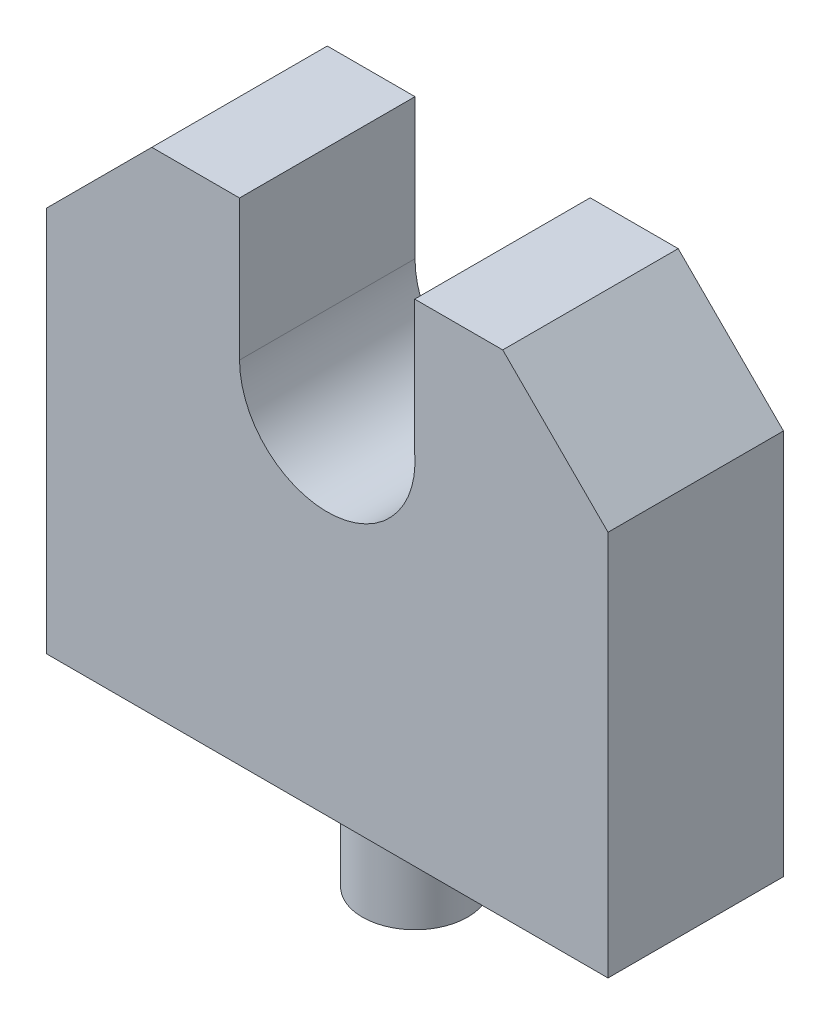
ISO-10303-21;
HEADER;
FILE_DESCRIPTION(('STEP AP214'),'2;1');
FILE_NAME('part.step','',(''),(''),'','','');
FILE_SCHEMA(('AUTOMOTIVE_DESIGN { 1 0 10303 214 1 1 1 1 }'));
ENDSEC;
DATA;
#1=APPLICATION_CONTEXT('core data for automotive mechanical design processes');
#2=APPLICATION_PROTOCOL_DEFINITION('international standard','automotive_design',2000,#1);
#3=PRODUCT_CONTEXT('',#1,'mechanical');
#4=PRODUCT('Part','Part','',(#3));
#5=PRODUCT_RELATED_PRODUCT_CATEGORY('part','',(#4));
#6=PRODUCT_DEFINITION_FORMATION('','',#4);
#7=PRODUCT_DEFINITION_CONTEXT('part definition',#1,'design');
#8=PRODUCT_DEFINITION('design','',#6,#7);
#9=PRODUCT_DEFINITION_SHAPE('','',#8);
#10=(LENGTH_UNIT() NAMED_UNIT(*) SI_UNIT(.MILLI.,.METRE.));
#11=(NAMED_UNIT(*) PLANE_ANGLE_UNIT() SI_UNIT($,.RADIAN.));
#12=(NAMED_UNIT(*) SI_UNIT($,.STERADIAN.) SOLID_ANGLE_UNIT());
#13=UNCERTAINTY_MEASURE_WITH_UNIT(LENGTH_MEASURE(1.E-05),#10,'distance_accuracy_value','');
#14=(GEOMETRIC_REPRESENTATION_CONTEXT(3) GLOBAL_UNCERTAINTY_ASSIGNED_CONTEXT((#13)) GLOBAL_UNIT_ASSIGNED_CONTEXT((#10,
#11,#12)) REPRESENTATION_CONTEXT('',''));
#15=CARTESIAN_POINT('',(0.,0.,0.));
#16=DIRECTION('',(0.,0.,1.));
#17=DIRECTION('',(1.,0.,0.));
#18=AXIS2_PLACEMENT_3D('',#15,#16,#17);
#19=CARTESIAN_POINT('',(0.,0.,50.));
#20=DIRECTION('',(0.,1.,0.));
#21=DIRECTION('',(0.,0.,1.));
#22=AXIS2_PLACEMENT_3D('',#19,#20,#21);
#23=PLANE('',#22);
#24=DIRECTION('',(1.,0.,0.));
#25=VECTOR('',#24,1.);
#26=CARTESIAN_POINT('',(0.,0.,0.));
#27=LINE('',#26,#25);
#28=CARTESIAN_POINT('',(0.,0.,0.));
#29=VERTEX_POINT('',#28);
#30=CARTESIAN_POINT('',(160.,0.,0.));
#31=VERTEX_POINT('',#30);
#32=EDGE_CURVE('E140',#29,#31,#27,.T.);
#33=ORIENTED_EDGE('',*,*,#32,.T.);
#34=DIRECTION('',(0.,0.,-1.));
#35=VECTOR('',#34,1.);
#36=CARTESIAN_POINT('',(160.,0.,50.));
#37=LINE('',#36,#35);
#38=CARTESIAN_POINT('',(160.,0.,50.));
#39=VERTEX_POINT('',#38);
#40=EDGE_CURVE('E155',#39,#31,#37,.T.);
#41=ORIENTED_EDGE('',*,*,#40,.F.);
#42=DIRECTION('',(1.,0.,0.));
#43=VECTOR('',#42,1.);
#44=CARTESIAN_POINT('',(0.,0.,50.));
#45=LINE('',#44,#43);
#46=CARTESIAN_POINT('',(0.,0.,50.));
#47=VERTEX_POINT('',#46);
#48=EDGE_CURVE('E148',#47,#39,#45,.T.);
#49=ORIENTED_EDGE('',*,*,#48,.F.);
#50=DIRECTION('',(0.,0.,-1.));
#51=VECTOR('',#50,1.);
#52=CARTESIAN_POINT('',(0.,0.,50.));
#53=LINE('',#52,#51);
#54=EDGE_CURVE('E163',#47,#29,#53,.T.);
#55=ORIENTED_EDGE('',*,*,#54,.T.);
#56=EDGE_LOOP('',(#33,#41,#49,#55));
#57=FACE_BOUND('',#56,.T.);
#58=CARTESIAN_POINT('',(80.,0.,25.));
#59=DIRECTION('',(0.,1.,0.));
#60=DIRECTION('',(0.,0.,1.));
#61=AXIS2_PLACEMENT_3D('',#58,#59,#60);
#62=CIRCLE('',#61,15.);
#63=CARTESIAN_POINT('',(80.,0.,40.));
#64=VERTEX_POINT('',#63);
#65=EDGE_CURVE('E167',#64,#64,#62,.F.);
#66=ORIENTED_EDGE('',*,*,#65,.F.);
#67=EDGE_LOOP('',(#66));
#68=FACE_BOUND('',#67,.T.);
#69=ADVANCED_FACE('F33',(#57,#68),#23,.F.);
#70=CARTESIAN_POINT('',(0.,140.,50.));
#71=DIRECTION('',(0.,-1.,0.));
#72=DIRECTION('',(0.,0.,-1.));
#73=AXIS2_PLACEMENT_3D('',#70,#71,#72);
#74=PLANE('',#73);
#75=DIRECTION('',(-1.,0.,0.));
#76=VECTOR('',#75,1.);
#77=CARTESIAN_POINT('',(0.,140.,0.));
#78=LINE('',#77,#76);
#79=CARTESIAN_POINT('',(55.,140.,0.));
#80=VERTEX_POINT('',#79);
#81=CARTESIAN_POINT('',(30.0000000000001,140.,0.));
#82=VERTEX_POINT('',#81);
#83=EDGE_CURVE('E131',#80,#82,#78,.T.);
#84=ORIENTED_EDGE('',*,*,#83,.T.);
#85=DIRECTION('',(0.,0.,1.));
#86=VECTOR('',#85,1.);
#87=CARTESIAN_POINT('',(30.0000000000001,140.,50.));
#88=LINE('',#87,#86);
#89=CARTESIAN_POINT('',(30.0000000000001,140.,50.));
#90=VERTEX_POINT('',#89);
#91=EDGE_CURVE('E177',#82,#90,#88,.T.);
#92=ORIENTED_EDGE('',*,*,#91,.T.);
#93=DIRECTION('',(-1.,0.,0.));
#94=VECTOR('',#93,1.);
#95=CARTESIAN_POINT('',(0.,140.,50.));
#96=LINE('',#95,#94);
#97=CARTESIAN_POINT('',(55.,140.,50.));
#98=VERTEX_POINT('',#97);
#99=EDGE_CURVE('E153',#98,#90,#96,.T.);
#100=ORIENTED_EDGE('',*,*,#99,.F.);
#101=DIRECTION('',(0.,0.,1.));
#102=VECTOR('',#101,1.);
#103=CARTESIAN_POINT('',(55.,140.,0.));
#104=LINE('',#103,#102);
#105=EDGE_CURVE('E142',#80,#98,#104,.T.);
#106=ORIENTED_EDGE('',*,*,#105,.F.);
#107=EDGE_LOOP('',(#84,#92,#100,#106));
#108=FACE_BOUND('',#107,.T.);
#109=ADVANCED_FACE('F205',(#108),#74,.F.);
#110=CARTESIAN_POINT('',(0.,0.,50.));
#111=DIRECTION('',(1.,0.,0.));
#112=DIRECTION('',(0.,0.,-1.));
#113=AXIS2_PLACEMENT_3D('',#110,#111,#112);
#114=PLANE('',#113);
#115=DIRECTION('',(0.,-1.,0.));
#116=VECTOR('',#115,1.);
#117=CARTESIAN_POINT('',(0.,0.,50.));
#118=LINE('',#117,#116);
#119=CARTESIAN_POINT('',(0.,110.,50.));
#120=VERTEX_POINT('',#119);
#121=EDGE_CURVE('E146',#120,#47,#118,.T.);
#122=ORIENTED_EDGE('',*,*,#121,.F.);
#123=DIRECTION('',(0.,0.,-1.));
#124=VECTOR('',#123,1.);
#125=CARTESIAN_POINT('',(0.,110.,50.));
#126=LINE('',#125,#124);
#127=CARTESIAN_POINT('',(0.,110.,0.));
#128=VERTEX_POINT('',#127);
#129=EDGE_CURVE('E170',#120,#128,#126,.T.);
#130=ORIENTED_EDGE('',*,*,#129,.T.);
#131=DIRECTION('',(0.,-1.,0.));
#132=VECTOR('',#131,1.);
#133=CARTESIAN_POINT('',(0.,0.,0.));
#134=LINE('',#133,#132);
#135=EDGE_CURVE('E137',#128,#29,#134,.T.);
#136=ORIENTED_EDGE('',*,*,#135,.T.);
#137=ORIENTED_EDGE('',*,*,#54,.F.);
#138=EDGE_LOOP('',(#122,#130,#136,#137));
#139=FACE_BOUND('',#138,.T.);
#140=ADVANCED_FACE('F214',(#139),#114,.F.);
#141=CARTESIAN_POINT('',(160.,0.,50.));
#142=DIRECTION('',(-1.,0.,0.));
#143=DIRECTION('',(0.,0.,1.));
#144=AXIS2_PLACEMENT_3D('',#141,#142,#143);
#145=PLANE('',#144);
#146=DIRECTION('',(0.,1.,0.));
#147=VECTOR('',#146,1.);
#148=CARTESIAN_POINT('',(160.,0.,0.));
#149=LINE('',#148,#147);
#150=CARTESIAN_POINT('',(160.,110.,0.));
#151=VERTEX_POINT('',#150);
#152=EDGE_CURVE('E158',#31,#151,#149,.T.);
#153=ORIENTED_EDGE('',*,*,#152,.T.);
#154=DIRECTION('',(0.,0.,1.));
#155=VECTOR('',#154,1.);
#156=CARTESIAN_POINT('',(160.,110.,50.));
#157=LINE('',#156,#155);
#158=CARTESIAN_POINT('',(160.,110.,50.));
#159=VERTEX_POINT('',#158);
#160=EDGE_CURVE('E11',#151,#159,#157,.T.);
#161=ORIENTED_EDGE('',*,*,#160,.T.);
#162=DIRECTION('',(0.,1.,0.));
#163=VECTOR('',#162,1.);
#164=CARTESIAN_POINT('',(160.,0.,50.));
#165=LINE('',#164,#163);
#166=EDGE_CURVE('E151',#39,#159,#165,.T.);
#167=ORIENTED_EDGE('',*,*,#166,.F.);
#168=ORIENTED_EDGE('',*,*,#40,.T.);
#169=EDGE_LOOP('',(#153,#161,#167,#168));
#170=FACE_BOUND('',#169,.T.);
#171=ADVANCED_FACE('F232',(#170),#145,.F.);
#172=CARTESIAN_POINT('',(130.,140.,50.));
#173=VERTEX_POINT('',#172);
#174=CARTESIAN_POINT('',(104.916562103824,140.,50.));
#175=VERTEX_POINT('',#174);
#176=EDGE_CURVE('E154',#173,#175,#96,.T.);
#177=ORIENTED_EDGE('',*,*,#176,.F.);
#178=DIRECTION('',(0.,0.,-1.));
#179=VECTOR('',#178,1.);
#180=CARTESIAN_POINT('',(130.,140.,50.));
#181=LINE('',#180,#179);
#182=CARTESIAN_POINT('',(130.,140.,0.));
#183=VERTEX_POINT('',#182);
#184=EDGE_CURVE('E41',#173,#183,#181,.T.);
#185=ORIENTED_EDGE('',*,*,#184,.T.);
#186=CARTESIAN_POINT('',(104.916562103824,140.,0.));
#187=VERTEX_POINT('',#186);
#188=EDGE_CURVE('E149',#183,#187,#78,.T.);
#189=ORIENTED_EDGE('',*,*,#188,.T.);
#190=DIRECTION('',(0.,0.,1.));
#191=VECTOR('',#190,1.);
#192=CARTESIAN_POINT('',(104.916562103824,140.,0.));
#193=LINE('',#192,#191);
#194=EDGE_CURVE('E120',#187,#175,#193,.T.);
#195=ORIENTED_EDGE('',*,*,#194,.T.);
#196=EDGE_LOOP('',(#177,#185,#189,#195));
#197=FACE_BOUND('',#196,.T.);
#198=ADVANCED_FACE('F185',(#197),#74,.F.);
#199=CARTESIAN_POINT('',(0.,140.,50.));
#200=DIRECTION('',(0.,0.,-1.));
#201=DIRECTION('',(-1.,0.,0.));
#202=AXIS2_PLACEMENT_3D('',#199,#200,#201);
#203=PLANE('',#202);
#204=ORIENTED_EDGE('',*,*,#99,.T.);
#205=DIRECTION('',(0.707106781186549,0.707106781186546,0.));
#206=VECTOR('',#205,1.);
#207=CARTESIAN_POINT('',(0.,110.,50.));
#208=LINE('',#207,#206);
#209=EDGE_CURVE('E180',#90,#120,#208,.F.);
#210=ORIENTED_EDGE('',*,*,#209,.T.);
#211=ORIENTED_EDGE('',*,*,#121,.T.);
#212=ORIENTED_EDGE('',*,*,#48,.T.);
#213=ORIENTED_EDGE('',*,*,#166,.T.);
#214=DIRECTION('',(0.707106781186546,-0.707106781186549,0.));
#215=VECTOR('',#214,1.);
#216=CARTESIAN_POINT('',(130.,140.,50.));
#217=LINE('',#216,#215);
#218=EDGE_CURVE('E48',#159,#173,#217,.F.);
#219=ORIENTED_EDGE('',*,*,#218,.T.);
#220=ORIENTED_EDGE('',*,*,#176,.T.);
#221=DIRECTION('',(0.,1.,0.));
#222=VECTOR('',#221,1.);
#223=CARTESIAN_POINT('',(104.916562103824,100.,50.));
#224=LINE('',#223,#222);
#225=CARTESIAN_POINT('',(104.916562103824,102.040816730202,50.));
#226=VERTEX_POINT('',#225);
#227=EDGE_CURVE('E132',#226,#175,#224,.T.);
#228=ORIENTED_EDGE('',*,*,#227,.F.);
#229=CARTESIAN_POINT('',(80.,100.,50.));
#230=DIRECTION('',(0.,0.,1.));
#231=DIRECTION('',(1.,0.,0.));
#232=AXIS2_PLACEMENT_3D('',#229,#230,#231);
#233=CIRCLE('',#232,25.);
#234=CARTESIAN_POINT('',(55.,100.,50.));
#235=VERTEX_POINT('',#234);
#236=EDGE_CURVE('E138',#235,#226,#233,.T.);
#237=ORIENTED_EDGE('',*,*,#236,.F.);
#238=DIRECTION('',(0.,-1.,0.));
#239=VECTOR('',#238,1.);
#240=CARTESIAN_POINT('',(55.,100.,50.));
#241=LINE('',#240,#239);
#242=EDGE_CURVE('E115',#98,#235,#241,.T.);
#243=ORIENTED_EDGE('',*,*,#242,.F.);
#244=EDGE_LOOP('',(#204,#210,#211,#212,#213,#219,#220,#228,#237,#243));
#245=FACE_BOUND('',#244,.T.);
#246=ADVANCED_FACE('F201',(#245),#203,.F.);
#247=CARTESIAN_POINT('',(0.,140.,0.));
#248=DIRECTION('',(0.,0.,-1.));
#249=DIRECTION('',(-1.,0.,0.));
#250=AXIS2_PLACEMENT_3D('',#247,#248,#249);
#251=PLANE('',#250);
#252=ORIENTED_EDGE('',*,*,#135,.F.);
#253=DIRECTION('',(-0.707106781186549,-0.707106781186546,0.));
#254=VECTOR('',#253,1.);
#255=CARTESIAN_POINT('',(15.,125.,0.));
#256=LINE('',#255,#254);
#257=EDGE_CURVE('E175',#128,#82,#256,.F.);
#258=ORIENTED_EDGE('',*,*,#257,.T.);
#259=ORIENTED_EDGE('',*,*,#83,.F.);
#260=DIRECTION('',(0.,-1.,0.));
#261=VECTOR('',#260,1.);
#262=CARTESIAN_POINT('',(55.,100.,0.));
#263=LINE('',#262,#261);
#264=CARTESIAN_POINT('',(55.,100.,0.));
#265=VERTEX_POINT('',#264);
#266=EDGE_CURVE('E112',#80,#265,#263,.T.);
#267=ORIENTED_EDGE('',*,*,#266,.T.);
#268=CARTESIAN_POINT('',(80.,100.,0.));
#269=DIRECTION('',(0.,0.,1.));
#270=DIRECTION('',(1.,0.,0.));
#271=AXIS2_PLACEMENT_3D('',#268,#269,#270);
#272=CIRCLE('',#271,25.);
#273=CARTESIAN_POINT('',(104.916562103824,102.040816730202,0.));
#274=VERTEX_POINT('',#273);
#275=EDGE_CURVE('E129',#265,#274,#272,.T.);
#276=ORIENTED_EDGE('',*,*,#275,.T.);
#277=DIRECTION('',(0.,1.,0.));
#278=VECTOR('',#277,1.);
#279=CARTESIAN_POINT('',(104.916562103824,100.,0.));
#280=LINE('',#279,#278);
#281=EDGE_CURVE('E121',#274,#187,#280,.T.);
#282=ORIENTED_EDGE('',*,*,#281,.T.);
#283=ORIENTED_EDGE('',*,*,#188,.F.);
#284=DIRECTION('',(-0.707106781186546,0.707106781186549,0.));
#285=VECTOR('',#284,1.);
#286=CARTESIAN_POINT('',(65.0000000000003,205.,0.));
#287=LINE('',#286,#285);
#288=EDGE_CURVE('E173',#183,#151,#287,.F.);
#289=ORIENTED_EDGE('',*,*,#288,.T.);
#290=ORIENTED_EDGE('',*,*,#152,.F.);
#291=ORIENTED_EDGE('',*,*,#32,.F.);
#292=EDGE_LOOP('',(#252,#258,#259,#267,#276,#282,#283,#289,#290,#291));
#293=FACE_BOUND('',#292,.T.);
#294=ADVANCED_FACE('F127',(#293),#251,.T.);
#295=CARTESIAN_POINT('',(80.,100.,0.));
#296=DIRECTION('',(0.,0.,1.));
#297=DIRECTION('',(1.,0.,0.));
#298=AXIS2_PLACEMENT_3D('',#295,#296,#297);
#299=CYLINDRICAL_SURFACE('',#298,25.);
#300=ORIENTED_EDGE('',*,*,#236,.T.);
#301=DIRECTION('',(0.,0.,1.));
#302=VECTOR('',#301,1.);
#303=CARTESIAN_POINT('',(104.916562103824,102.040816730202,0.));
#304=LINE('',#303,#302);
#305=EDGE_CURVE('E136',#226,#274,#304,.F.);
#306=ORIENTED_EDGE('',*,*,#305,.T.);
#307=ORIENTED_EDGE('',*,*,#275,.F.);
#308=DIRECTION('',(0.,0.,1.));
#309=VECTOR('',#308,1.);
#310=CARTESIAN_POINT('',(55.,100.,0.));
#311=LINE('',#310,#309);
#312=EDGE_CURVE('E109',#265,#235,#311,.T.);
#313=ORIENTED_EDGE('',*,*,#312,.T.);
#314=EDGE_LOOP('',(#300,#306,#307,#313));
#315=FACE_BOUND('',#314,.T.);
#316=ADVANCED_FACE('F135',(#315),#299,.F.);
#317=CARTESIAN_POINT('',(55.,100.,0.));
#318=DIRECTION('',(-1.,0.,0.));
#319=DIRECTION('',(0.,0.,1.));
#320=AXIS2_PLACEMENT_3D('',#317,#318,#319);
#321=PLANE('',#320);
#322=ORIENTED_EDGE('',*,*,#242,.T.);
#323=ORIENTED_EDGE('',*,*,#312,.F.);
#324=ORIENTED_EDGE('',*,*,#266,.F.);
#325=ORIENTED_EDGE('',*,*,#105,.T.);
#326=EDGE_LOOP('',(#322,#323,#324,#325));
#327=FACE_BOUND('',#326,.T.);
#328=ADVANCED_FACE('F111',(#327),#321,.F.);
#329=CARTESIAN_POINT('',(104.916562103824,100.,0.));
#330=DIRECTION('',(1.,0.,0.));
#331=DIRECTION('',(0.,0.,-1.));
#332=AXIS2_PLACEMENT_3D('',#329,#330,#331);
#333=PLANE('',#332);
#334=ORIENTED_EDGE('',*,*,#227,.T.);
#335=ORIENTED_EDGE('',*,*,#194,.F.);
#336=ORIENTED_EDGE('',*,*,#281,.F.);
#337=ORIENTED_EDGE('',*,*,#305,.F.);
#338=EDGE_LOOP('',(#334,#335,#336,#337));
#339=FACE_BOUND('',#338,.T.);
#340=ADVANCED_FACE('F198',(#339),#333,.F.);
#341=CARTESIAN_POINT('',(80.,-30.,25.));
#342=DIRECTION('',(0.,1.,0.));
#343=DIRECTION('',(0.,0.,1.));
#344=AXIS2_PLACEMENT_3D('',#341,#342,#343);
#345=CYLINDRICAL_SURFACE('',#344,15.);
#346=CARTESIAN_POINT('',(80.,-30.,25.));
#347=DIRECTION('',(0.,-1.,0.));
#348=DIRECTION('',(0.,0.,-1.));
#349=AXIS2_PLACEMENT_3D('',#346,#347,#348);
#350=CIRCLE('',#349,15.);
#351=CARTESIAN_POINT('',(80.,-30.,9.99999999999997));
#352=VERTEX_POINT('',#351);
#353=EDGE_CURVE('E195',#352,#352,#350,.T.);
#354=ORIENTED_EDGE('',*,*,#353,.F.);
#355=EDGE_LOOP('',(#354));
#356=FACE_BOUND('',#355,.T.);
#357=ORIENTED_EDGE('',*,*,#65,.T.);
#358=EDGE_LOOP('',(#357));
#359=FACE_BOUND('',#358,.T.);
#360=ADVANCED_FACE('F253',(#356,#359),#345,.T.);
#361=CARTESIAN_POINT('',(80.,-30.,25.));
#362=DIRECTION('',(0.,-1.,0.));
#363=DIRECTION('',(0.,0.,-1.));
#364=AXIS2_PLACEMENT_3D('',#361,#362,#363);
#365=PLANE('',#364);
#366=ORIENTED_EDGE('',*,*,#353,.T.);
#367=EDGE_LOOP('',(#366));
#368=FACE_BOUND('',#367,.T.);
#369=ADVANCED_FACE('F223',(#368),#365,.T.);
#370=CARTESIAN_POINT('',(0.,110.,50.));
#371=DIRECTION('',(0.707106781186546,-0.707106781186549,0.));
#372=DIRECTION('',(0.707106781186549,0.707106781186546,0.));
#373=AXIS2_PLACEMENT_3D('',#370,#371,#372);
#374=PLANE('',#373);
#375=ORIENTED_EDGE('',*,*,#209,.F.);
#376=ORIENTED_EDGE('',*,*,#91,.F.);
#377=ORIENTED_EDGE('',*,*,#257,.F.);
#378=ORIENTED_EDGE('',*,*,#129,.F.);
#379=EDGE_LOOP('',(#375,#376,#377,#378));
#380=FACE_BOUND('',#379,.T.);
#381=ADVANCED_FACE('F208',(#380),#374,.F.);
#382=CARTESIAN_POINT('',(130.,140.,50.));
#383=DIRECTION('',(-0.707106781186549,-0.707106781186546,0.));
#384=DIRECTION('',(0.707106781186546,-0.707106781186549,0.));
#385=AXIS2_PLACEMENT_3D('',#382,#383,#384);
#386=PLANE('',#385);
#387=ORIENTED_EDGE('',*,*,#218,.F.);
#388=ORIENTED_EDGE('',*,*,#160,.F.);
#389=ORIENTED_EDGE('',*,*,#288,.F.);
#390=ORIENTED_EDGE('',*,*,#184,.F.);
#391=EDGE_LOOP('',(#387,#388,#389,#390));
#392=FACE_BOUND('',#391,.T.);
#393=ADVANCED_FACE('F35',(#392),#386,.F.);
#394=CLOSED_SHELL('',(#69,#109,#140,#171,#198,#246,#294,#316,#328,#340,#360,#369,#381,#393));
#395=MANIFOLD_SOLID_BREP('B2',#394);
#396=ADVANCED_BREP_SHAPE_REPRESENTATION('',(#18,#395),#14);
#397=SHAPE_DEFINITION_REPRESENTATION(#9,#396);
ENDSEC;
END-ISO-10303-21;
